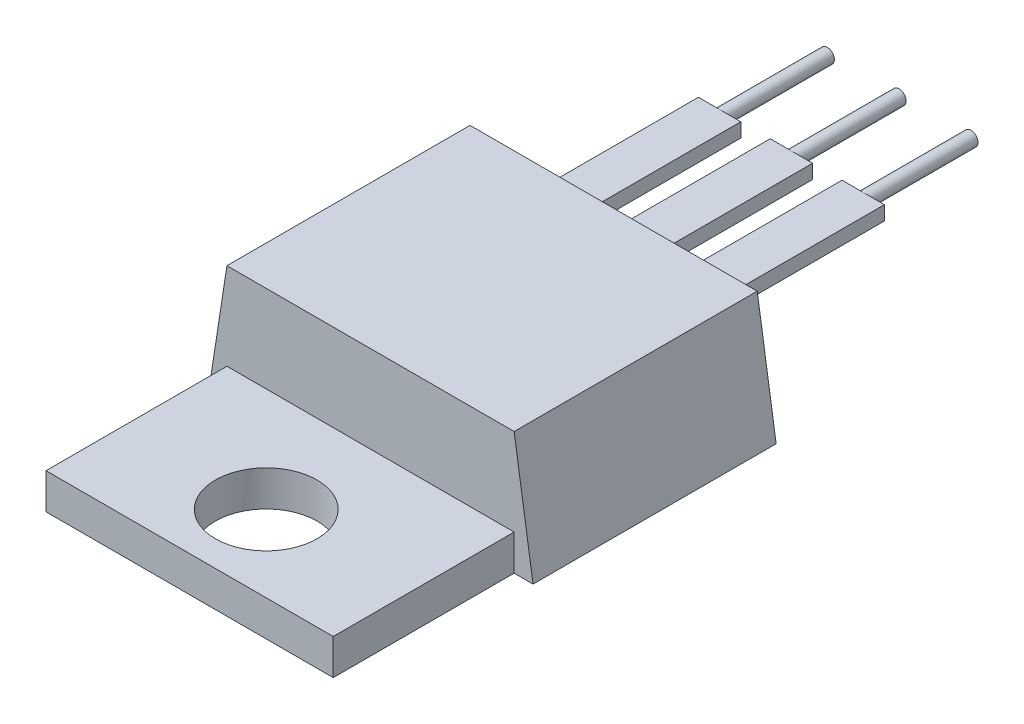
ISO-10303-21;
HEADER;
FILE_DESCRIPTION(('STEP AP214'),'2;1');
FILE_NAME('part.step','',(''),(''),'','','');
FILE_SCHEMA(('AUTOMOTIVE_DESIGN { 1 0 10303 214 1 1 1 1 }'));
ENDSEC;
DATA;
#1=APPLICATION_CONTEXT('core data for automotive mechanical design processes');
#2=APPLICATION_PROTOCOL_DEFINITION('international standard','automotive_design',2000,#1);
#3=PRODUCT_CONTEXT('',#1,'mechanical');
#4=PRODUCT('Part','Part','',(#3));
#5=PRODUCT_RELATED_PRODUCT_CATEGORY('part','',(#4));
#6=PRODUCT_DEFINITION_FORMATION('','',#4);
#7=PRODUCT_DEFINITION_CONTEXT('part definition',#1,'design');
#8=PRODUCT_DEFINITION('design','',#6,#7);
#9=PRODUCT_DEFINITION_SHAPE('','',#8);
#10=(LENGTH_UNIT() NAMED_UNIT(*) SI_UNIT(.MILLI.,.METRE.));
#11=(NAMED_UNIT(*) PLANE_ANGLE_UNIT() SI_UNIT($,.RADIAN.));
#12=(NAMED_UNIT(*) SI_UNIT($,.STERADIAN.) SOLID_ANGLE_UNIT());
#13=UNCERTAINTY_MEASURE_WITH_UNIT(LENGTH_MEASURE(1.E-05),#10,'distance_accuracy_value','');
#14=(GEOMETRIC_REPRESENTATION_CONTEXT(3) GLOBAL_UNCERTAINTY_ASSIGNED_CONTEXT((#13)) GLOBAL_UNIT_ASSIGNED_CONTEXT((#10,
#11,#12)) REPRESENTATION_CONTEXT('',''));
#15=CARTESIAN_POINT('',(0.,0.,0.));
#16=DIRECTION('',(0.,0.,1.));
#17=DIRECTION('',(1.,0.,0.));
#18=AXIS2_PLACEMENT_3D('',#15,#16,#17);
#19=CARTESIAN_POINT('',(-1.79,-0.25,-6.29));
#20=DIRECTION('',(0.,0.,-1.));
#21=DIRECTION('',(-1.,0.,0.));
#22=AXIS2_PLACEMENT_3D('',#19,#20,#21);
#23=PLANE('',#22);
#24=CARTESIAN_POINT('',(-2.54,0.,-6.29));
#25=DIRECTION('',(0.,0.,-1.));
#26=DIRECTION('',(-1.,0.,0.));
#27=AXIS2_PLACEMENT_3D('',#24,#25,#26);
#28=CIRCLE('',#27,0.25);
#29=CARTESIAN_POINT('',(-2.54,0.25,-6.29));
#30=VERTEX_POINT('',#29);
#31=CARTESIAN_POINT('',(-2.54,-0.25,-6.29));
#32=VERTEX_POINT('',#31);
#33=EDGE_CURVE('E52',#30,#32,#28,.T.);
#34=ORIENTED_EDGE('',*,*,#33,.F.);
#35=DIRECTION('',(1.,0.,0.));
#36=VECTOR('',#35,1.);
#37=CARTESIAN_POINT('',(-1.79,0.25,-6.29));
#38=LINE('',#37,#36);
#39=CARTESIAN_POINT('',(-1.79,0.25,-6.29));
#40=VERTEX_POINT('',#39);
#41=EDGE_CURVE('E66',#30,#40,#38,.T.);
#42=ORIENTED_EDGE('',*,*,#41,.T.);
#43=DIRECTION('',(0.,-1.,0.));
#44=VECTOR('',#43,1.);
#45=CARTESIAN_POINT('',(-1.79,0.25,-6.29));
#46=LINE('',#45,#44);
#47=CARTESIAN_POINT('',(-1.79,-0.25,-6.29));
#48=VERTEX_POINT('',#47);
#49=EDGE_CURVE('E159',#40,#48,#46,.T.);
#50=ORIENTED_EDGE('',*,*,#49,.T.);
#51=DIRECTION('',(-1.,0.,0.));
#52=VECTOR('',#51,1.);
#53=CARTESIAN_POINT('',(-1.79,-0.25,-6.29));
#54=LINE('',#53,#52);
#55=EDGE_CURVE('E95',#48,#32,#54,.T.);
#56=ORIENTED_EDGE('',*,*,#55,.T.);
#57=EDGE_LOOP('',(#34,#42,#50,#56));
#58=FACE_BOUND('',#57,.T.);
#59=ADVANCED_FACE('F42',(#58),#23,.T.);
#60=CARTESIAN_POINT('',(-1.79,0.25,-6.29));
#61=DIRECTION('',(-1.,0.,0.));
#62=DIRECTION('',(0.,-1.,0.));
#63=AXIS2_PLACEMENT_3D('',#60,#61,#62);
#64=PLANE('',#63);
#65=DIRECTION('',(0.,-1.,0.));
#66=VECTOR('',#65,1.);
#67=CARTESIAN_POINT('',(-1.79,0.25,0.));
#68=LINE('',#67,#66);
#69=CARTESIAN_POINT('',(-1.79,0.25,0.));
#70=VERTEX_POINT('',#69);
#71=CARTESIAN_POINT('',(-1.79,-0.25,0.));
#72=VERTEX_POINT('',#71);
#73=EDGE_CURVE('E155',#70,#72,#68,.T.);
#74=ORIENTED_EDGE('',*,*,#73,.T.);
#75=DIRECTION('',(0.,0.,1.));
#76=VECTOR('',#75,1.);
#77=CARTESIAN_POINT('',(-1.79,-0.25,-6.29));
#78=LINE('',#77,#76);
#79=EDGE_CURVE('E46',#48,#72,#78,.T.);
#80=ORIENTED_EDGE('',*,*,#79,.F.);
#81=ORIENTED_EDGE('',*,*,#49,.F.);
#82=DIRECTION('',(0.,0.,1.));
#83=VECTOR('',#82,1.);
#84=CARTESIAN_POINT('',(-1.79,0.25,-6.29));
#85=LINE('',#84,#83);
#86=EDGE_CURVE('E103',#40,#70,#85,.T.);
#87=ORIENTED_EDGE('',*,*,#86,.T.);
#88=EDGE_LOOP('',(#74,#80,#81,#87));
#89=FACE_BOUND('',#88,.T.);
#90=ADVANCED_FACE('F44',(#89),#64,.F.);
#91=CARTESIAN_POINT('',(-1.79,-0.25,-6.29));
#92=DIRECTION('',(0.,1.,0.));
#93=DIRECTION('',(0.,0.,1.));
#94=AXIS2_PLACEMENT_3D('',#91,#92,#93);
#95=PLANE('',#94);
#96=DIRECTION('',(-1.,0.,0.));
#97=VECTOR('',#96,1.);
#98=CARTESIAN_POINT('',(-1.79,-0.25,0.));
#99=LINE('',#98,#97);
#100=CARTESIAN_POINT('',(-3.29,-0.25,0.));
#101=VERTEX_POINT('',#100);
#102=EDGE_CURVE('E147',#72,#101,#99,.T.);
#103=ORIENTED_EDGE('',*,*,#102,.T.);
#104=DIRECTION('',(0.,0.,1.));
#105=VECTOR('',#104,1.);
#106=CARTESIAN_POINT('',(-3.29,-0.25,-6.29));
#107=LINE('',#106,#105);
#108=CARTESIAN_POINT('',(-3.29,-0.25,-6.29));
#109=VERTEX_POINT('',#108);
#110=EDGE_CURVE('E149',#109,#101,#107,.T.);
#111=ORIENTED_EDGE('',*,*,#110,.F.);
#112=EDGE_CURVE('E169',#32,#109,#54,.T.);
#113=ORIENTED_EDGE('',*,*,#112,.F.);
#114=ORIENTED_EDGE('',*,*,#55,.F.);
#115=ORIENTED_EDGE('',*,*,#79,.T.);
#116=EDGE_LOOP('',(#103,#111,#113,#114,#115));
#117=FACE_BOUND('',#116,.T.);
#118=ADVANCED_FACE('F130',(#117),#95,.F.);
#119=CARTESIAN_POINT('',(-3.29,0.25,-6.29));
#120=DIRECTION('',(1.,0.,0.));
#121=DIRECTION('',(0.,0.,-1.));
#122=AXIS2_PLACEMENT_3D('',#119,#120,#121);
#123=PLANE('',#122);
#124=DIRECTION('',(0.,1.,0.));
#125=VECTOR('',#124,1.);
#126=CARTESIAN_POINT('',(-3.29,0.25,0.));
#127=LINE('',#126,#125);
#128=CARTESIAN_POINT('',(-3.29,0.25,0.));
#129=VERTEX_POINT('',#128);
#130=EDGE_CURVE('E154',#101,#129,#127,.T.);
#131=ORIENTED_EDGE('',*,*,#130,.T.);
#132=DIRECTION('',(0.,0.,1.));
#133=VECTOR('',#132,1.);
#134=CARTESIAN_POINT('',(-3.29,0.25,-6.29));
#135=LINE('',#134,#133);
#136=CARTESIAN_POINT('',(-3.29,0.25,-6.29));
#137=VERTEX_POINT('',#136);
#138=EDGE_CURVE('E157',#137,#129,#135,.T.);
#139=ORIENTED_EDGE('',*,*,#138,.F.);
#140=DIRECTION('',(0.,1.,0.));
#141=VECTOR('',#140,1.);
#142=CARTESIAN_POINT('',(-3.29,0.25,-6.29));
#143=LINE('',#142,#141);
#144=EDGE_CURVE('E101',#109,#137,#143,.T.);
#145=ORIENTED_EDGE('',*,*,#144,.F.);
#146=ORIENTED_EDGE('',*,*,#110,.T.);
#147=EDGE_LOOP('',(#131,#139,#145,#146));
#148=FACE_BOUND('',#147,.T.);
#149=ADVANCED_FACE('F136',(#148),#123,.F.);
#150=CARTESIAN_POINT('',(-1.79,0.25,-6.29));
#151=DIRECTION('',(0.,-1.,0.));
#152=DIRECTION('',(0.,0.,-1.));
#153=AXIS2_PLACEMENT_3D('',#150,#151,#152);
#154=PLANE('',#153);
#155=DIRECTION('',(1.,0.,0.));
#156=VECTOR('',#155,1.);
#157=CARTESIAN_POINT('',(-1.79,0.25,0.));
#158=LINE('',#157,#156);
#159=EDGE_CURVE('E88',#129,#70,#158,.T.);
#160=ORIENTED_EDGE('',*,*,#159,.T.);
#161=ORIENTED_EDGE('',*,*,#86,.F.);
#162=ORIENTED_EDGE('',*,*,#41,.F.);
#163=EDGE_CURVE('E98',#137,#30,#38,.T.);
#164=ORIENTED_EDGE('',*,*,#163,.F.);
#165=ORIENTED_EDGE('',*,*,#138,.T.);
#166=EDGE_LOOP('',(#160,#161,#162,#164,#165));
#167=FACE_BOUND('',#166,.T.);
#168=ADVANCED_FACE('F105',(#167),#154,.F.);
#169=EDGE_CURVE('E12',#32,#30,#28,.T.);
#170=ORIENTED_EDGE('',*,*,#169,.F.);
#171=ORIENTED_EDGE('',*,*,#112,.T.);
#172=ORIENTED_EDGE('',*,*,#144,.T.);
#173=ORIENTED_EDGE('',*,*,#163,.T.);
#174=EDGE_LOOP('',(#170,#171,#172,#173));
#175=FACE_BOUND('',#174,.T.);
#176=ADVANCED_FACE('F99',(#175),#23,.T.);
#177=CARTESIAN_POINT('',(-1.79,-0.25,0.));
#178=DIRECTION('',(0.,0.,-1.));
#179=DIRECTION('',(-1.,0.,0.));
#180=AXIS2_PLACEMENT_3D('',#177,#178,#179);
#181=PLANE('',#180);
#182=ORIENTED_EDGE('',*,*,#73,.F.);
#183=ORIENTED_EDGE('',*,*,#159,.F.);
#184=ORIENTED_EDGE('',*,*,#130,.F.);
#185=ORIENTED_EDGE('',*,*,#102,.F.);
#186=EDGE_LOOP('',(#182,#183,#184,#185));
#187=FACE_BOUND('',#186,.T.);
#188=ADVANCED_FACE('F113',(#187),#181,.F.);
#189=CARTESIAN_POINT('',(-2.54,0.,-10.1));
#190=DIRECTION('',(0.,0.,1.));
#191=DIRECTION('',(1.,0.,0.));
#192=AXIS2_PLACEMENT_3D('',#189,#190,#191);
#193=CYLINDRICAL_SURFACE('',#192,0.25);
#194=CARTESIAN_POINT('',(-2.54,0.,-10.1));
#195=DIRECTION('',(0.,0.,-1.));
#196=DIRECTION('',(-1.,0.,0.));
#197=AXIS2_PLACEMENT_3D('',#194,#195,#196);
#198=CIRCLE('',#197,0.25);
#199=CARTESIAN_POINT('',(-2.79,0.,-10.1));
#200=VERTEX_POINT('',#199);
#201=EDGE_CURVE('E109',#200,#200,#198,.T.);
#202=ORIENTED_EDGE('',*,*,#201,.F.);
#203=EDGE_LOOP('',(#202));
#204=FACE_BOUND('',#203,.T.);
#205=ORIENTED_EDGE('',*,*,#33,.T.);
#206=ORIENTED_EDGE('',*,*,#169,.T.);
#207=EDGE_LOOP('',(#205,#206));
#208=FACE_BOUND('',#207,.T.);
#209=ADVANCED_FACE('F110',(#204,#208),#193,.T.);
#210=CARTESIAN_POINT('',(-2.54,0.,-10.1));
#211=DIRECTION('',(0.,0.,-1.));
#212=DIRECTION('',(-1.,0.,0.));
#213=AXIS2_PLACEMENT_3D('',#210,#211,#212);
#214=PLANE('',#213);
#215=ORIENTED_EDGE('',*,*,#201,.T.);
#216=EDGE_LOOP('',(#215));
#217=FACE_BOUND('',#216,.T.);
#218=ADVANCED_FACE('F112',(#217),#214,.T.);
#219=CLOSED_SHELL('',(#59,#90,#118,#149,#168,#176,#188,#209,#218));
#220=MANIFOLD_SOLID_BREP('B2',#219);
#221=CARTESIAN_POINT('',(1.79,-0.25,-6.29));
#222=DIRECTION('',(0.,0.,1.));
#223=DIRECTION('',(1.,0.,0.));
#224=AXIS2_PLACEMENT_3D('',#221,#222,#223);
#225=PLANE('',#224);
#226=CARTESIAN_POINT('',(2.54,0.,-6.29));
#227=DIRECTION('',(0.,0.,-1.));
#228=DIRECTION('',(-1.,0.,0.));
#229=AXIS2_PLACEMENT_3D('',#226,#227,#228);
#230=CIRCLE('',#229,0.25);
#231=CARTESIAN_POINT('',(2.54,0.25,-6.29));
#232=VERTEX_POINT('',#231);
#233=CARTESIAN_POINT('',(2.54,-0.25,-6.29));
#234=VERTEX_POINT('',#233);
#235=EDGE_CURVE('E237',#232,#234,#230,.T.);
#236=ORIENTED_EDGE('',*,*,#235,.F.);
#237=DIRECTION('',(1.,0.,0.));
#238=VECTOR('',#237,1.);
#239=CARTESIAN_POINT('',(1.79,0.25,-6.29));
#240=LINE('',#239,#238);
#241=CARTESIAN_POINT('',(3.29,0.25,-6.29));
#242=VERTEX_POINT('',#241);
#243=EDGE_CURVE('E284',#232,#242,#240,.T.);
#244=ORIENTED_EDGE('',*,*,#243,.T.);
#245=DIRECTION('',(0.,-1.,0.));
#246=VECTOR('',#245,1.);
#247=CARTESIAN_POINT('',(3.29,0.25,-6.29));
#248=LINE('',#247,#246);
#249=CARTESIAN_POINT('',(3.29,-0.25,-6.29));
#250=VERTEX_POINT('',#249);
#251=EDGE_CURVE('E283',#242,#250,#248,.T.);
#252=ORIENTED_EDGE('',*,*,#251,.T.);
#253=DIRECTION('',(-1.,0.,0.));
#254=VECTOR('',#253,1.);
#255=CARTESIAN_POINT('',(1.79,-0.25,-6.29));
#256=LINE('',#255,#254);
#257=EDGE_CURVE('E296',#250,#234,#256,.T.);
#258=ORIENTED_EDGE('',*,*,#257,.T.);
#259=EDGE_LOOP('',(#236,#244,#252,#258));
#260=FACE_BOUND('',#259,.T.);
#261=ADVANCED_FACE('F227',(#260),#225,.F.);
#262=EDGE_CURVE('E40',#234,#232,#230,.T.);
#263=ORIENTED_EDGE('',*,*,#262,.F.);
#264=CARTESIAN_POINT('',(1.79,-0.25,-6.29));
#265=VERTEX_POINT('',#264);
#266=EDGE_CURVE('E247',#234,#265,#256,.T.);
#267=ORIENTED_EDGE('',*,*,#266,.T.);
#268=DIRECTION('',(0.,1.,0.));
#269=VECTOR('',#268,1.);
#270=CARTESIAN_POINT('',(1.79,0.25,-6.29));
#271=LINE('',#270,#269);
#272=CARTESIAN_POINT('',(1.79,0.25,-6.29));
#273=VERTEX_POINT('',#272);
#274=EDGE_CURVE('E281',#265,#273,#271,.T.);
#275=ORIENTED_EDGE('',*,*,#274,.T.);
#276=EDGE_CURVE('E276',#273,#232,#240,.T.);
#277=ORIENTED_EDGE('',*,*,#276,.T.);
#278=EDGE_LOOP('',(#263,#267,#275,#277));
#279=FACE_BOUND('',#278,.T.);
#280=ADVANCED_FACE('F279',(#279),#225,.F.);
#281=CARTESIAN_POINT('',(1.79,0.25,-6.29));
#282=DIRECTION('',(1.,0.,0.));
#283=DIRECTION('',(0.,0.,-1.));
#284=AXIS2_PLACEMENT_3D('',#281,#282,#283);
#285=PLANE('',#284);
#286=DIRECTION('',(0.,1.,0.));
#287=VECTOR('',#286,1.);
#288=CARTESIAN_POINT('',(1.79,0.25,0.));
#289=LINE('',#288,#287);
#290=CARTESIAN_POINT('',(1.79,-0.25,0.));
#291=VERTEX_POINT('',#290);
#292=CARTESIAN_POINT('',(1.79,0.25,0.));
#293=VERTEX_POINT('',#292);
#294=EDGE_CURVE('E335',#291,#293,#289,.T.);
#295=ORIENTED_EDGE('',*,*,#294,.T.);
#296=DIRECTION('',(0.,0.,1.));
#297=VECTOR('',#296,1.);
#298=CARTESIAN_POINT('',(1.79,0.25,-6.29));
#299=LINE('',#298,#297);
#300=EDGE_CURVE('E231',#273,#293,#299,.T.);
#301=ORIENTED_EDGE('',*,*,#300,.F.);
#302=ORIENTED_EDGE('',*,*,#274,.F.);
#303=DIRECTION('',(0.,0.,1.));
#304=VECTOR('',#303,1.);
#305=CARTESIAN_POINT('',(1.79,-0.25,-6.29));
#306=LINE('',#305,#304);
#307=EDGE_CURVE('E336',#265,#291,#306,.T.);
#308=ORIENTED_EDGE('',*,*,#307,.T.);
#309=EDGE_LOOP('',(#295,#301,#302,#308));
#310=FACE_BOUND('',#309,.T.);
#311=ADVANCED_FACE('F229',(#310),#285,.F.);
#312=CARTESIAN_POINT('',(1.79,0.25,-6.29));
#313=DIRECTION('',(0.,-1.,0.));
#314=DIRECTION('',(0.,0.,-1.));
#315=AXIS2_PLACEMENT_3D('',#312,#313,#314);
#316=PLANE('',#315);
#317=DIRECTION('',(1.,0.,0.));
#318=VECTOR('',#317,1.);
#319=CARTESIAN_POINT('',(1.79,0.25,0.));
#320=LINE('',#319,#318);
#321=CARTESIAN_POINT('',(3.29,0.25,0.));
#322=VERTEX_POINT('',#321);
#323=EDGE_CURVE('E337',#293,#322,#320,.T.);
#324=ORIENTED_EDGE('',*,*,#323,.T.);
#325=DIRECTION('',(0.,0.,1.));
#326=VECTOR('',#325,1.);
#327=CARTESIAN_POINT('',(3.29,0.25,-6.29));
#328=LINE('',#327,#326);
#329=EDGE_CURVE('E290',#242,#322,#328,.T.);
#330=ORIENTED_EDGE('',*,*,#329,.F.);
#331=ORIENTED_EDGE('',*,*,#243,.F.);
#332=ORIENTED_EDGE('',*,*,#276,.F.);
#333=ORIENTED_EDGE('',*,*,#300,.T.);
#334=EDGE_LOOP('',(#324,#330,#331,#332,#333));
#335=FACE_BOUND('',#334,.T.);
#336=ADVANCED_FACE('F288',(#335),#316,.F.);
#337=CARTESIAN_POINT('',(3.29,0.25,-6.29));
#338=DIRECTION('',(-1.,0.,0.));
#339=DIRECTION('',(0.,0.,1.));
#340=AXIS2_PLACEMENT_3D('',#337,#338,#339);
#341=PLANE('',#340);
#342=DIRECTION('',(0.,-1.,0.));
#343=VECTOR('',#342,1.);
#344=CARTESIAN_POINT('',(3.29,0.25,0.));
#345=LINE('',#344,#343);
#346=CARTESIAN_POINT('',(3.29,-0.25,0.));
#347=VERTEX_POINT('',#346);
#348=EDGE_CURVE('E339',#322,#347,#345,.T.);
#349=ORIENTED_EDGE('',*,*,#348,.T.);
#350=DIRECTION('',(0.,0.,1.));
#351=VECTOR('',#350,1.);
#352=CARTESIAN_POINT('',(3.29,-0.25,-6.29));
#353=LINE('',#352,#351);
#354=EDGE_CURVE('E349',#250,#347,#353,.T.);
#355=ORIENTED_EDGE('',*,*,#354,.F.);
#356=ORIENTED_EDGE('',*,*,#251,.F.);
#357=ORIENTED_EDGE('',*,*,#329,.T.);
#358=EDGE_LOOP('',(#349,#355,#356,#357));
#359=FACE_BOUND('',#358,.T.);
#360=ADVANCED_FACE('F323',(#359),#341,.F.);
#361=CARTESIAN_POINT('',(1.79,-0.25,-6.29));
#362=DIRECTION('',(0.,1.,0.));
#363=DIRECTION('',(0.,0.,1.));
#364=AXIS2_PLACEMENT_3D('',#361,#362,#363);
#365=PLANE('',#364);
#366=DIRECTION('',(-1.,0.,0.));
#367=VECTOR('',#366,1.);
#368=CARTESIAN_POINT('',(1.79,-0.25,0.));
#369=LINE('',#368,#367);
#370=EDGE_CURVE('E269',#347,#291,#369,.T.);
#371=ORIENTED_EDGE('',*,*,#370,.T.);
#372=ORIENTED_EDGE('',*,*,#307,.F.);
#373=ORIENTED_EDGE('',*,*,#266,.F.);
#374=ORIENTED_EDGE('',*,*,#257,.F.);
#375=ORIENTED_EDGE('',*,*,#354,.T.);
#376=EDGE_LOOP('',(#371,#372,#373,#374,#375));
#377=FACE_BOUND('',#376,.T.);
#378=ADVANCED_FACE('F311',(#377),#365,.F.);
#379=CARTESIAN_POINT('',(1.79,-0.25,0.));
#380=DIRECTION('',(0.,0.,1.));
#381=DIRECTION('',(1.,0.,0.));
#382=AXIS2_PLACEMENT_3D('',#379,#380,#381);
#383=PLANE('',#382);
#384=ORIENTED_EDGE('',*,*,#294,.F.);
#385=ORIENTED_EDGE('',*,*,#370,.F.);
#386=ORIENTED_EDGE('',*,*,#348,.F.);
#387=ORIENTED_EDGE('',*,*,#323,.F.);
#388=EDGE_LOOP('',(#384,#385,#386,#387));
#389=FACE_BOUND('',#388,.T.);
#390=ADVANCED_FACE('F302',(#389),#383,.T.);
#391=CARTESIAN_POINT('',(2.54,0.,-10.1));
#392=DIRECTION('',(0.,0.,1.));
#393=DIRECTION('',(1.,0.,0.));
#394=AXIS2_PLACEMENT_3D('',#391,#392,#393);
#395=CYLINDRICAL_SURFACE('',#394,0.25);
#396=CARTESIAN_POINT('',(2.54,0.,-10.1));
#397=DIRECTION('',(0.,0.,-1.));
#398=DIRECTION('',(-1.,0.,0.));
#399=AXIS2_PLACEMENT_3D('',#396,#397,#398);
#400=CIRCLE('',#399,0.25);
#401=CARTESIAN_POINT('',(2.29,0.,-10.1));
#402=VERTEX_POINT('',#401);
#403=EDGE_CURVE('E298',#402,#402,#400,.T.);
#404=ORIENTED_EDGE('',*,*,#403,.F.);
#405=EDGE_LOOP('',(#404));
#406=FACE_BOUND('',#405,.T.);
#407=ORIENTED_EDGE('',*,*,#235,.T.);
#408=ORIENTED_EDGE('',*,*,#262,.T.);
#409=EDGE_LOOP('',(#407,#408));
#410=FACE_BOUND('',#409,.T.);
#411=ADVANCED_FACE('F299',(#406,#410),#395,.T.);
#412=CARTESIAN_POINT('',(2.54,0.,-10.1));
#413=DIRECTION('',(0.,0.,-1.));
#414=DIRECTION('',(-1.,0.,0.));
#415=AXIS2_PLACEMENT_3D('',#412,#413,#414);
#416=PLANE('',#415);
#417=ORIENTED_EDGE('',*,*,#403,.T.);
#418=EDGE_LOOP('',(#417));
#419=FACE_BOUND('',#418,.T.);
#420=ADVANCED_FACE('F301',(#419),#416,.T.);
#421=CLOSED_SHELL('',(#261,#280,#311,#336,#360,#378,#390,#411,#420));
#422=MANIFOLD_SOLID_BREP('B6',#421);
#423=CARTESIAN_POINT('',(0.75,-0.25,-6.29));
#424=DIRECTION('',(0.,0.,-1.));
#425=DIRECTION('',(-1.,0.,0.));
#426=AXIS2_PLACEMENT_3D('',#423,#424,#425);
#427=PLANE('',#426);
#428=CARTESIAN_POINT('',(0.,0.,-6.29));
#429=DIRECTION('',(0.,0.,-1.));
#430=DIRECTION('',(-1.,0.,0.));
#431=AXIS2_PLACEMENT_3D('',#428,#429,#430);
#432=CIRCLE('',#431,0.25);
#433=CARTESIAN_POINT('',(0.,0.25,-6.29));
#434=VERTEX_POINT('',#433);
#435=CARTESIAN_POINT('',(0.,-0.25,-6.29));
#436=VERTEX_POINT('',#435);
#437=EDGE_CURVE('E422',#434,#436,#432,.T.);
#438=ORIENTED_EDGE('',*,*,#437,.F.);
#439=DIRECTION('',(1.,0.,0.));
#440=VECTOR('',#439,1.);
#441=CARTESIAN_POINT('',(0.75,0.25,-6.29));
#442=LINE('',#441,#440);
#443=CARTESIAN_POINT('',(0.75,0.25,-6.29));
#444=VERTEX_POINT('',#443);
#445=EDGE_CURVE('E436',#434,#444,#442,.T.);
#446=ORIENTED_EDGE('',*,*,#445,.T.);
#447=DIRECTION('',(0.,-1.,0.));
#448=VECTOR('',#447,1.);
#449=CARTESIAN_POINT('',(0.75,0.25,-6.29));
#450=LINE('',#449,#448);
#451=CARTESIAN_POINT('',(0.75,-0.25,-6.29));
#452=VERTEX_POINT('',#451);
#453=EDGE_CURVE('E529',#444,#452,#450,.T.);
#454=ORIENTED_EDGE('',*,*,#453,.T.);
#455=DIRECTION('',(-1.,0.,0.));
#456=VECTOR('',#455,1.);
#457=CARTESIAN_POINT('',(0.75,-0.25,-6.29));
#458=LINE('',#457,#456);
#459=EDGE_CURVE('E465',#452,#436,#458,.T.);
#460=ORIENTED_EDGE('',*,*,#459,.T.);
#461=EDGE_LOOP('',(#438,#446,#454,#460));
#462=FACE_BOUND('',#461,.T.);
#463=ADVANCED_FACE('F412',(#462),#427,.T.);
#464=CARTESIAN_POINT('',(0.75,0.25,-6.29));
#465=DIRECTION('',(-1.,0.,0.));
#466=DIRECTION('',(0.,0.,1.));
#467=AXIS2_PLACEMENT_3D('',#464,#465,#466);
#468=PLANE('',#467);
#469=DIRECTION('',(0.,-1.,0.));
#470=VECTOR('',#469,1.);
#471=CARTESIAN_POINT('',(0.75,0.25,0.));
#472=LINE('',#471,#470);
#473=CARTESIAN_POINT('',(0.75,0.25,0.));
#474=VERTEX_POINT('',#473);
#475=CARTESIAN_POINT('',(0.75,-0.25,0.));
#476=VERTEX_POINT('',#475);
#477=EDGE_CURVE('E525',#474,#476,#472,.T.);
#478=ORIENTED_EDGE('',*,*,#477,.T.);
#479=DIRECTION('',(0.,0.,1.));
#480=VECTOR('',#479,1.);
#481=CARTESIAN_POINT('',(0.75,-0.25,-6.29));
#482=LINE('',#481,#480);
#483=EDGE_CURVE('E416',#452,#476,#482,.T.);
#484=ORIENTED_EDGE('',*,*,#483,.F.);
#485=ORIENTED_EDGE('',*,*,#453,.F.);
#486=DIRECTION('',(0.,0.,1.));
#487=VECTOR('',#486,1.);
#488=CARTESIAN_POINT('',(0.75,0.25,-6.29));
#489=LINE('',#488,#487);
#490=EDGE_CURVE('E473',#444,#474,#489,.T.);
#491=ORIENTED_EDGE('',*,*,#490,.T.);
#492=EDGE_LOOP('',(#478,#484,#485,#491));
#493=FACE_BOUND('',#492,.T.);
#494=ADVANCED_FACE('F414',(#493),#468,.F.);
#495=CARTESIAN_POINT('',(0.75,-0.25,-6.29));
#496=DIRECTION('',(0.,1.,0.));
#497=DIRECTION('',(0.,0.,1.));
#498=AXIS2_PLACEMENT_3D('',#495,#496,#497);
#499=PLANE('',#498);
#500=DIRECTION('',(-1.,0.,0.));
#501=VECTOR('',#500,1.);
#502=CARTESIAN_POINT('',(0.75,-0.25,0.));
#503=LINE('',#502,#501);
#504=CARTESIAN_POINT('',(-0.75,-0.25,0.));
#505=VERTEX_POINT('',#504);
#506=EDGE_CURVE('E517',#476,#505,#503,.T.);
#507=ORIENTED_EDGE('',*,*,#506,.T.);
#508=DIRECTION('',(0.,0.,1.));
#509=VECTOR('',#508,1.);
#510=CARTESIAN_POINT('',(-0.75,-0.25,-6.29));
#511=LINE('',#510,#509);
#512=CARTESIAN_POINT('',(-0.75,-0.25,-6.29));
#513=VERTEX_POINT('',#512);
#514=EDGE_CURVE('E519',#513,#505,#511,.T.);
#515=ORIENTED_EDGE('',*,*,#514,.F.);
#516=EDGE_CURVE('E539',#436,#513,#458,.T.);
#517=ORIENTED_EDGE('',*,*,#516,.F.);
#518=ORIENTED_EDGE('',*,*,#459,.F.);
#519=ORIENTED_EDGE('',*,*,#483,.T.);
#520=EDGE_LOOP('',(#507,#515,#517,#518,#519));
#521=FACE_BOUND('',#520,.T.);
#522=ADVANCED_FACE('F500',(#521),#499,.F.);
#523=CARTESIAN_POINT('',(-0.75,0.25,-6.29));
#524=DIRECTION('',(1.,0.,0.));
#525=DIRECTION('',(0.,0.,-1.));
#526=AXIS2_PLACEMENT_3D('',#523,#524,#525);
#527=PLANE('',#526);
#528=DIRECTION('',(0.,1.,0.));
#529=VECTOR('',#528,1.);
#530=CARTESIAN_POINT('',(-0.75,0.25,0.));
#531=LINE('',#530,#529);
#532=CARTESIAN_POINT('',(-0.75,0.25,0.));
#533=VERTEX_POINT('',#532);
#534=EDGE_CURVE('E524',#505,#533,#531,.T.);
#535=ORIENTED_EDGE('',*,*,#534,.T.);
#536=DIRECTION('',(0.,0.,1.));
#537=VECTOR('',#536,1.);
#538=CARTESIAN_POINT('',(-0.75,0.25,-6.29));
#539=LINE('',#538,#537);
#540=CARTESIAN_POINT('',(-0.75,0.25,-6.29));
#541=VERTEX_POINT('',#540);
#542=EDGE_CURVE('E527',#541,#533,#539,.T.);
#543=ORIENTED_EDGE('',*,*,#542,.F.);
#544=DIRECTION('',(0.,1.,0.));
#545=VECTOR('',#544,1.);
#546=CARTESIAN_POINT('',(-0.75,0.25,-6.29));
#547=LINE('',#546,#545);
#548=EDGE_CURVE('E471',#513,#541,#547,.T.);
#549=ORIENTED_EDGE('',*,*,#548,.F.);
#550=ORIENTED_EDGE('',*,*,#514,.T.);
#551=EDGE_LOOP('',(#535,#543,#549,#550));
#552=FACE_BOUND('',#551,.T.);
#553=ADVANCED_FACE('F506',(#552),#527,.F.);
#554=CARTESIAN_POINT('',(0.75,0.25,-6.29));
#555=DIRECTION('',(0.,-1.,0.));
#556=DIRECTION('',(0.,0.,-1.));
#557=AXIS2_PLACEMENT_3D('',#554,#555,#556);
#558=PLANE('',#557);
#559=DIRECTION('',(1.,0.,0.));
#560=VECTOR('',#559,1.);
#561=CARTESIAN_POINT('',(0.75,0.25,0.));
#562=LINE('',#561,#560);
#563=EDGE_CURVE('E458',#533,#474,#562,.T.);
#564=ORIENTED_EDGE('',*,*,#563,.T.);
#565=ORIENTED_EDGE('',*,*,#490,.F.);
#566=ORIENTED_EDGE('',*,*,#445,.F.);
#567=EDGE_CURVE('E468',#541,#434,#442,.T.);
#568=ORIENTED_EDGE('',*,*,#567,.F.);
#569=ORIENTED_EDGE('',*,*,#542,.T.);
#570=EDGE_LOOP('',(#564,#565,#566,#568,#569));
#571=FACE_BOUND('',#570,.T.);
#572=ADVANCED_FACE('F475',(#571),#558,.F.);
#573=EDGE_CURVE('E225',#436,#434,#432,.T.);
#574=ORIENTED_EDGE('',*,*,#573,.F.);
#575=ORIENTED_EDGE('',*,*,#516,.T.);
#576=ORIENTED_EDGE('',*,*,#548,.T.);
#577=ORIENTED_EDGE('',*,*,#567,.T.);
#578=EDGE_LOOP('',(#574,#575,#576,#577));
#579=FACE_BOUND('',#578,.T.);
#580=ADVANCED_FACE('F469',(#579),#427,.T.);
#581=CARTESIAN_POINT('',(0.75,-0.25,0.));
#582=DIRECTION('',(0.,0.,-1.));
#583=DIRECTION('',(-1.,0.,0.));
#584=AXIS2_PLACEMENT_3D('',#581,#582,#583);
#585=PLANE('',#584);
#586=ORIENTED_EDGE('',*,*,#477,.F.);
#587=ORIENTED_EDGE('',*,*,#563,.F.);
#588=ORIENTED_EDGE('',*,*,#534,.F.);
#589=ORIENTED_EDGE('',*,*,#506,.F.);
#590=EDGE_LOOP('',(#586,#587,#588,#589));
#591=FACE_BOUND('',#590,.T.);
#592=ADVANCED_FACE('F483',(#591),#585,.F.);
#593=CARTESIAN_POINT('',(0.,0.,-10.1));
#594=DIRECTION('',(0.,0.,1.));
#595=DIRECTION('',(1.,0.,0.));
#596=AXIS2_PLACEMENT_3D('',#593,#594,#595);
#597=CYLINDRICAL_SURFACE('',#596,0.25);
#598=CARTESIAN_POINT('',(0.,0.,-10.1));
#599=DIRECTION('',(0.,0.,-1.));
#600=DIRECTION('',(-1.,0.,0.));
#601=AXIS2_PLACEMENT_3D('',#598,#599,#600);
#602=CIRCLE('',#601,0.25);
#603=CARTESIAN_POINT('',(-0.25,0.,-10.1));
#604=VERTEX_POINT('',#603);
#605=EDGE_CURVE('E479',#604,#604,#602,.T.);
#606=ORIENTED_EDGE('',*,*,#605,.F.);
#607=EDGE_LOOP('',(#606));
#608=FACE_BOUND('',#607,.T.);
#609=ORIENTED_EDGE('',*,*,#437,.T.);
#610=ORIENTED_EDGE('',*,*,#573,.T.);
#611=EDGE_LOOP('',(#609,#610));
#612=FACE_BOUND('',#611,.T.);
#613=ADVANCED_FACE('F480',(#608,#612),#597,.T.);
#614=CARTESIAN_POINT('',(0.,0.,-10.1));
#615=DIRECTION('',(0.,0.,-1.));
#616=DIRECTION('',(-1.,0.,0.));
#617=AXIS2_PLACEMENT_3D('',#614,#615,#616);
#618=PLANE('',#617);
#619=ORIENTED_EDGE('',*,*,#605,.T.);
#620=EDGE_LOOP('',(#619));
#621=FACE_BOUND('',#620,.T.);
#622=ADVANCED_FACE('F482',(#621),#618,.T.);
#623=CLOSED_SHELL('',(#463,#494,#522,#553,#572,#580,#592,#613,#622));
#624=MANIFOLD_SOLID_BREP('B34',#623);
#625=CARTESIAN_POINT('',(-5.08,-2.7,1.));
#626=DIRECTION('',(-1.,0.,0.));
#627=DIRECTION('',(0.,0.,1.));
#628=AXIS2_PLACEMENT_3D('',#625,#626,#627);
#629=PLANE('',#628);
#630=DIRECTION('',(0.,0.,1.));
#631=VECTOR('',#630,1.);
#632=CARTESIAN_POINT('',(-5.08,-2.7,1.));
#633=LINE('',#632,#631);
#634=CARTESIAN_POINT('',(-5.08,-2.7,1.));
#635=VERTEX_POINT('',#634);
#636=CARTESIAN_POINT('',(-5.08,-2.7,15.));
#637=VERTEX_POINT('',#636);
#638=EDGE_CURVE('E599',#635,#637,#633,.T.);
#639=ORIENTED_EDGE('',*,*,#638,.T.);
#640=DIRECTION('',(0.,-1.,0.));
#641=VECTOR('',#640,1.);
#642=CARTESIAN_POINT('',(-5.08,-2.7,15.));
#643=LINE('',#642,#641);
#644=CARTESIAN_POINT('',(-5.08,-1.44,15.));
#645=VERTEX_POINT('',#644);
#646=EDGE_CURVE('E636',#645,#637,#643,.T.);
#647=ORIENTED_EDGE('',*,*,#646,.F.);
#648=DIRECTION('',(0.,0.,1.));
#649=VECTOR('',#648,1.);
#650=CARTESIAN_POINT('',(-5.08,-1.44,1.));
#651=LINE('',#650,#649);
#652=CARTESIAN_POINT('',(-5.08,-1.44,1.));
#653=VERTEX_POINT('',#652);
#654=EDGE_CURVE('E410',#653,#645,#651,.T.);
#655=ORIENTED_EDGE('',*,*,#654,.F.);
#656=DIRECTION('',(0.,-1.,0.));
#657=VECTOR('',#656,1.);
#658=CARTESIAN_POINT('',(-5.08,-2.7,1.));
#659=LINE('',#658,#657);
#660=EDGE_CURVE('E637',#653,#635,#659,.T.);
#661=ORIENTED_EDGE('',*,*,#660,.T.);
#662=EDGE_LOOP('',(#639,#647,#655,#661));
#663=FACE_BOUND('',#662,.T.);
#664=ADVANCED_FACE('F596',(#663),#629,.T.);
#665=CARTESIAN_POINT('',(-5.08,-1.44,1.));
#666=DIRECTION('',(0.,1.,0.));
#667=DIRECTION('',(0.,0.,1.));
#668=AXIS2_PLACEMENT_3D('',#665,#666,#667);
#669=PLANE('',#668);
#670=CARTESIAN_POINT('',(0.,-1.44,12.29));
#671=DIRECTION('',(0.,1.,0.));
#672=DIRECTION('',(0.,0.,1.));
#673=AXIS2_PLACEMENT_3D('',#670,#671,#672);
#674=CIRCLE('',#673,1.8);
#675=CARTESIAN_POINT('',(0.,-1.44,14.09));
#676=VERTEX_POINT('',#675);
#677=EDGE_CURVE('E657',#676,#676,#674,.T.);
#678=ORIENTED_EDGE('',*,*,#677,.F.);
#679=EDGE_LOOP('',(#678));
#680=FACE_BOUND('',#679,.T.);
#681=ORIENTED_EDGE('',*,*,#654,.T.);
#682=DIRECTION('',(-1.,0.,0.));
#683=VECTOR('',#682,1.);
#684=CARTESIAN_POINT('',(-5.08,-1.44,15.));
#685=LINE('',#684,#683);
#686=CARTESIAN_POINT('',(5.08,-1.44,15.));
#687=VERTEX_POINT('',#686);
#688=EDGE_CURVE('E653',#687,#645,#685,.T.);
#689=ORIENTED_EDGE('',*,*,#688,.F.);
#690=DIRECTION('',(0.,0.,1.));
#691=VECTOR('',#690,1.);
#692=CARTESIAN_POINT('',(5.08,-1.44,1.));
#693=LINE('',#692,#691);
#694=CARTESIAN_POINT('',(5.08,-1.44,1.));
#695=VERTEX_POINT('',#694);
#696=EDGE_CURVE('E604',#695,#687,#693,.T.);
#697=ORIENTED_EDGE('',*,*,#696,.F.);
#698=DIRECTION('',(-1.,0.,0.));
#699=VECTOR('',#698,1.);
#700=CARTESIAN_POINT('',(-5.08,-1.44,1.));
#701=LINE('',#700,#699);
#702=EDGE_CURVE('E642',#695,#653,#701,.T.);
#703=ORIENTED_EDGE('',*,*,#702,.T.);
#704=EDGE_LOOP('',(#681,#689,#697,#703));
#705=FACE_BOUND('',#704,.T.);
#706=ADVANCED_FACE('F673',(#680,#705),#669,.T.);
#707=CARTESIAN_POINT('',(5.08,-2.7,1.));
#708=DIRECTION('',(1.,0.,0.));
#709=DIRECTION('',(0.,0.,-1.));
#710=AXIS2_PLACEMENT_3D('',#707,#708,#709);
#711=PLANE('',#710);
#712=ORIENTED_EDGE('',*,*,#696,.T.);
#713=DIRECTION('',(0.,1.,0.));
#714=VECTOR('',#713,1.);
#715=CARTESIAN_POINT('',(5.08,-2.7,15.));
#716=LINE('',#715,#714);
#717=CARTESIAN_POINT('',(5.08,-2.7,15.));
#718=VERTEX_POINT('',#717);
#719=EDGE_CURVE('E649',#718,#687,#716,.T.);
#720=ORIENTED_EDGE('',*,*,#719,.F.);
#721=DIRECTION('',(0.,0.,1.));
#722=VECTOR('',#721,1.);
#723=CARTESIAN_POINT('',(5.08,-2.7,1.));
#724=LINE('',#723,#722);
#725=CARTESIAN_POINT('',(5.08,-2.7,1.));
#726=VERTEX_POINT('',#725);
#727=EDGE_CURVE('E641',#726,#718,#724,.T.);
#728=ORIENTED_EDGE('',*,*,#727,.F.);
#729=DIRECTION('',(0.,1.,0.));
#730=VECTOR('',#729,1.);
#731=CARTESIAN_POINT('',(5.08,-2.7,1.));
#732=LINE('',#731,#730);
#733=EDGE_CURVE('E666',#726,#695,#732,.T.);
#734=ORIENTED_EDGE('',*,*,#733,.T.);
#735=EDGE_LOOP('',(#712,#720,#728,#734));
#736=FACE_BOUND('',#735,.T.);
#737=ADVANCED_FACE('F670',(#736),#711,.T.);
#738=CARTESIAN_POINT('',(-5.08,-2.7,1.));
#739=DIRECTION('',(0.,-1.,0.));
#740=DIRECTION('',(0.,0.,-1.));
#741=AXIS2_PLACEMENT_3D('',#738,#739,#740);
#742=PLANE('',#741);
#743=CARTESIAN_POINT('',(0.,-2.7,12.29));
#744=DIRECTION('',(0.,-1.,0.));
#745=DIRECTION('',(0.,0.,-1.));
#746=AXIS2_PLACEMENT_3D('',#743,#744,#745);
#747=CIRCLE('',#746,1.8);
#748=CARTESIAN_POINT('',(0.,-2.7,10.49));
#749=VERTEX_POINT('',#748);
#750=EDGE_CURVE('E654',#749,#749,#747,.F.);
#751=ORIENTED_EDGE('',*,*,#750,.T.);
#752=EDGE_LOOP('',(#751));
#753=FACE_BOUND('',#752,.T.);
#754=ORIENTED_EDGE('',*,*,#727,.T.);
#755=DIRECTION('',(1.,0.,0.));
#756=VECTOR('',#755,1.);
#757=CARTESIAN_POINT('',(-5.08,-2.7,15.));
#758=LINE('',#757,#756);
#759=EDGE_CURVE('E644',#637,#718,#758,.T.);
#760=ORIENTED_EDGE('',*,*,#759,.F.);
#761=ORIENTED_EDGE('',*,*,#638,.F.);
#762=DIRECTION('',(1.,0.,0.));
#763=VECTOR('',#762,1.);
#764=CARTESIAN_POINT('',(-5.08,-2.7,1.));
#765=LINE('',#764,#763);
#766=EDGE_CURVE('E664',#635,#726,#765,.T.);
#767=ORIENTED_EDGE('',*,*,#766,.T.);
#768=EDGE_LOOP('',(#754,#760,#761,#767));
#769=FACE_BOUND('',#768,.T.);
#770=ADVANCED_FACE('F645',(#753,#769),#742,.T.);
#771=CARTESIAN_POINT('',(-5.08,-1.44,1.));
#772=DIRECTION('',(0.,0.,-1.));
#773=DIRECTION('',(-1.,0.,0.));
#774=AXIS2_PLACEMENT_3D('',#771,#772,#773);
#775=PLANE('',#774);
#776=ORIENTED_EDGE('',*,*,#660,.F.);
#777=ORIENTED_EDGE('',*,*,#702,.F.);
#778=ORIENTED_EDGE('',*,*,#733,.F.);
#779=ORIENTED_EDGE('',*,*,#766,.F.);
#780=EDGE_LOOP('',(#776,#777,#778,#779));
#781=FACE_BOUND('',#780,.T.);
#782=ADVANCED_FACE('F675',(#781),#775,.T.);
#783=CARTESIAN_POINT('',(-5.08,-1.44,15.));
#784=DIRECTION('',(0.,0.,-1.));
#785=DIRECTION('',(-1.,0.,0.));
#786=AXIS2_PLACEMENT_3D('',#783,#784,#785);
#787=PLANE('',#786);
#788=ORIENTED_EDGE('',*,*,#646,.T.);
#789=ORIENTED_EDGE('',*,*,#759,.T.);
#790=ORIENTED_EDGE('',*,*,#719,.T.);
#791=ORIENTED_EDGE('',*,*,#688,.T.);
#792=EDGE_LOOP('',(#788,#789,#790,#791));
#793=FACE_BOUND('',#792,.T.);
#794=ADVANCED_FACE('F652',(#793),#787,.F.);
#795=CARTESIAN_POINT('',(0.,-7.79116882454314,12.29));
#796=DIRECTION('',(0.,1.,0.));
#797=DIRECTION('',(0.,0.,1.));
#798=AXIS2_PLACEMENT_3D('',#795,#796,#797);
#799=CYLINDRICAL_SURFACE('',#798,1.8);
#800=ORIENTED_EDGE('',*,*,#677,.T.);
#801=EDGE_LOOP('',(#800));
#802=FACE_BOUND('',#801,.T.);
#803=ORIENTED_EDGE('',*,*,#750,.F.);
#804=EDGE_LOOP('',(#803));
#805=FACE_BOUND('',#804,.T.);
#806=ADVANCED_FACE('F682',(#802,#805),#799,.F.);
#807=CLOSED_SHELL('',(#664,#706,#737,#770,#782,#794,#806));
#808=MANIFOLD_SOLID_BREP('B219',#807);
#809=CARTESIAN_POINT('',(-5.75,-2.7,8.6));
#810=DIRECTION('',(0.988292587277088,-0.152570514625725,0.));
#811=DIRECTION('',(0.152570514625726,0.988292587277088,0.));
#812=AXIS2_PLACEMENT_3D('',#809,#810,#811);
#813=PLANE('',#812);
#814=DIRECTION('',(-0.152570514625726,-0.988292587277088,0.));
#815=VECTOR('',#814,1.);
#816=CARTESIAN_POINT('',(-5.75,-2.7,0.));
#817=LINE('',#816,#815);
#818=CARTESIAN_POINT('',(-5.08,1.64,0.));
#819=VERTEX_POINT('',#818);
#820=CARTESIAN_POINT('',(-5.75,-2.7,0.));
#821=VERTEX_POINT('',#820);
#822=EDGE_CURVE('E804',#819,#821,#817,.T.);
#823=ORIENTED_EDGE('',*,*,#822,.T.);
#824=DIRECTION('',(0.,0.,-1.));
#825=VECTOR('',#824,1.);
#826=CARTESIAN_POINT('',(-5.75,-2.7,8.6));
#827=LINE('',#826,#825);
#828=CARTESIAN_POINT('',(-5.75,-2.7,8.6));
#829=VERTEX_POINT('',#828);
#830=EDGE_CURVE('E594',#829,#821,#827,.T.);
#831=ORIENTED_EDGE('',*,*,#830,.F.);
#832=DIRECTION('',(-0.152570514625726,-0.988292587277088,0.));
#833=VECTOR('',#832,1.);
#834=CARTESIAN_POINT('',(-5.75,-2.7,8.6));
#835=LINE('',#834,#833);
#836=CARTESIAN_POINT('',(-5.08,1.64,8.6));
#837=VERTEX_POINT('',#836);
#838=EDGE_CURVE('E792',#837,#829,#835,.T.);
#839=ORIENTED_EDGE('',*,*,#838,.F.);
#840=DIRECTION('',(0.,0.,-1.));
#841=VECTOR('',#840,1.);
#842=CARTESIAN_POINT('',(-5.08,1.64,8.6));
#843=LINE('',#842,#841);
#844=EDGE_CURVE('E800',#837,#819,#843,.T.);
#845=ORIENTED_EDGE('',*,*,#844,.T.);
#846=EDGE_LOOP('',(#823,#831,#839,#845));
#847=FACE_BOUND('',#846,.T.);
#848=ADVANCED_FACE('F741',(#847),#813,.F.);
#849=CARTESIAN_POINT('',(-5.75,-2.7,8.6));
#850=DIRECTION('',(0.,1.,0.));
#851=DIRECTION('',(0.,0.,1.));
#852=AXIS2_PLACEMENT_3D('',#849,#850,#851);
#853=PLANE('',#852);
#854=DIRECTION('',(1.,0.,0.));
#855=VECTOR('',#854,1.);
#856=CARTESIAN_POINT('',(-5.75,-2.7,0.));
#857=LINE('',#856,#855);
#858=CARTESIAN_POINT('',(5.75,-2.7,0.));
#859=VERTEX_POINT('',#858);
#860=EDGE_CURVE('E796',#821,#859,#857,.T.);
#861=ORIENTED_EDGE('',*,*,#860,.T.);
#862=DIRECTION('',(0.,0.,-1.));
#863=VECTOR('',#862,1.);
#864=CARTESIAN_POINT('',(5.75,-2.7,8.6));
#865=LINE('',#864,#863);
#866=CARTESIAN_POINT('',(5.75,-2.7,8.6));
#867=VERTEX_POINT('',#866);
#868=EDGE_CURVE('E749',#867,#859,#865,.T.);
#869=ORIENTED_EDGE('',*,*,#868,.F.);
#870=DIRECTION('',(1.,0.,0.));
#871=VECTOR('',#870,1.);
#872=CARTESIAN_POINT('',(-5.75,-2.7,8.6));
#873=LINE('',#872,#871);
#874=EDGE_CURVE('E787',#829,#867,#873,.T.);
#875=ORIENTED_EDGE('',*,*,#874,.F.);
#876=ORIENTED_EDGE('',*,*,#830,.T.);
#877=EDGE_LOOP('',(#861,#869,#875,#876));
#878=FACE_BOUND('',#877,.T.);
#879=ADVANCED_FACE('F795',(#878),#853,.F.);
#880=CARTESIAN_POINT('',(5.75,-2.7,8.6));
#881=DIRECTION('',(-0.988292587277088,-0.152570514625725,0.));
#882=DIRECTION('',(0.152570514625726,-0.988292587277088,0.));
#883=AXIS2_PLACEMENT_3D('',#880,#881,#882);
#884=PLANE('',#883);
#885=DIRECTION('',(-0.152570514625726,0.988292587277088,0.));
#886=VECTOR('',#885,1.);
#887=CARTESIAN_POINT('',(5.75,-2.7,0.));
#888=LINE('',#887,#886);
#889=CARTESIAN_POINT('',(5.08,1.64,0.));
#890=VERTEX_POINT('',#889);
#891=EDGE_CURVE('E774',#859,#890,#888,.T.);
#892=ORIENTED_EDGE('',*,*,#891,.T.);
#893=DIRECTION('',(0.,0.,-1.));
#894=VECTOR('',#893,1.);
#895=CARTESIAN_POINT('',(5.08,1.64,8.6));
#896=LINE('',#895,#894);
#897=CARTESIAN_POINT('',(5.08,1.64,8.6));
#898=VERTEX_POINT('',#897);
#899=EDGE_CURVE('E797',#898,#890,#896,.T.);
#900=ORIENTED_EDGE('',*,*,#899,.F.);
#901=DIRECTION('',(-0.152570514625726,0.988292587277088,0.));
#902=VECTOR('',#901,1.);
#903=CARTESIAN_POINT('',(5.75,-2.7,8.6));
#904=LINE('',#903,#902);
#905=EDGE_CURVE('E790',#867,#898,#904,.T.);
#906=ORIENTED_EDGE('',*,*,#905,.F.);
#907=ORIENTED_EDGE('',*,*,#868,.T.);
#908=EDGE_LOOP('',(#892,#900,#906,#907));
#909=FACE_BOUND('',#908,.T.);
#910=ADVANCED_FACE('F798',(#909),#884,.F.);
#911=CARTESIAN_POINT('',(-5.08,1.64,8.6));
#912=DIRECTION('',(0.,-1.,0.));
#913=DIRECTION('',(0.,0.,-1.));
#914=AXIS2_PLACEMENT_3D('',#911,#912,#913);
#915=PLANE('',#914);
#916=DIRECTION('',(-1.,0.,0.));
#917=VECTOR('',#916,1.);
#918=CARTESIAN_POINT('',(-5.08,1.64,0.));
#919=LINE('',#918,#917);
#920=EDGE_CURVE('E780',#890,#819,#919,.T.);
#921=ORIENTED_EDGE('',*,*,#920,.T.);
#922=ORIENTED_EDGE('',*,*,#844,.F.);
#923=DIRECTION('',(-1.,0.,0.));
#924=VECTOR('',#923,1.);
#925=CARTESIAN_POINT('',(-5.08,1.64,8.6));
#926=LINE('',#925,#924);
#927=EDGE_CURVE('E757',#898,#837,#926,.T.);
#928=ORIENTED_EDGE('',*,*,#927,.F.);
#929=ORIENTED_EDGE('',*,*,#899,.T.);
#930=EDGE_LOOP('',(#921,#922,#928,#929));
#931=FACE_BOUND('',#930,.T.);
#932=ADVANCED_FACE('F811',(#931),#915,.F.);
#933=CARTESIAN_POINT('',(-5.08,1.64,8.6));
#934=DIRECTION('',(0.,0.,-1.));
#935=DIRECTION('',(-1.,0.,0.));
#936=AXIS2_PLACEMENT_3D('',#933,#934,#935);
#937=PLANE('',#936);
#938=ORIENTED_EDGE('',*,*,#838,.T.);
#939=ORIENTED_EDGE('',*,*,#874,.T.);
#940=ORIENTED_EDGE('',*,*,#905,.T.);
#941=ORIENTED_EDGE('',*,*,#927,.T.);
#942=EDGE_LOOP('',(#938,#939,#940,#941));
#943=FACE_BOUND('',#942,.T.);
#944=ADVANCED_FACE('F788',(#943),#937,.F.);
#945=CARTESIAN_POINT('',(-5.08,1.64,0.));
#946=DIRECTION('',(0.,0.,-1.));
#947=DIRECTION('',(-1.,0.,0.));
#948=AXIS2_PLACEMENT_3D('',#945,#946,#947);
#949=PLANE('',#948);
#950=ORIENTED_EDGE('',*,*,#822,.F.);
#951=ORIENTED_EDGE('',*,*,#920,.F.);
#952=ORIENTED_EDGE('',*,*,#891,.F.);
#953=ORIENTED_EDGE('',*,*,#860,.F.);
#954=EDGE_LOOP('',(#950,#951,#952,#953));
#955=FACE_BOUND('',#954,.T.);
#956=ADVANCED_FACE('F814',(#955),#949,.T.);
#957=CLOSED_SHELL('',(#848,#879,#910,#932,#944,#956));
#958=MANIFOLD_SOLID_BREP('B404',#957);
#959=ADVANCED_BREP_SHAPE_REPRESENTATION('',(#18,#220,#422,#624,#808,#958),#14);
#960=SHAPE_DEFINITION_REPRESENTATION(#9,#959);
ENDSEC;
END-ISO-10303-21;
